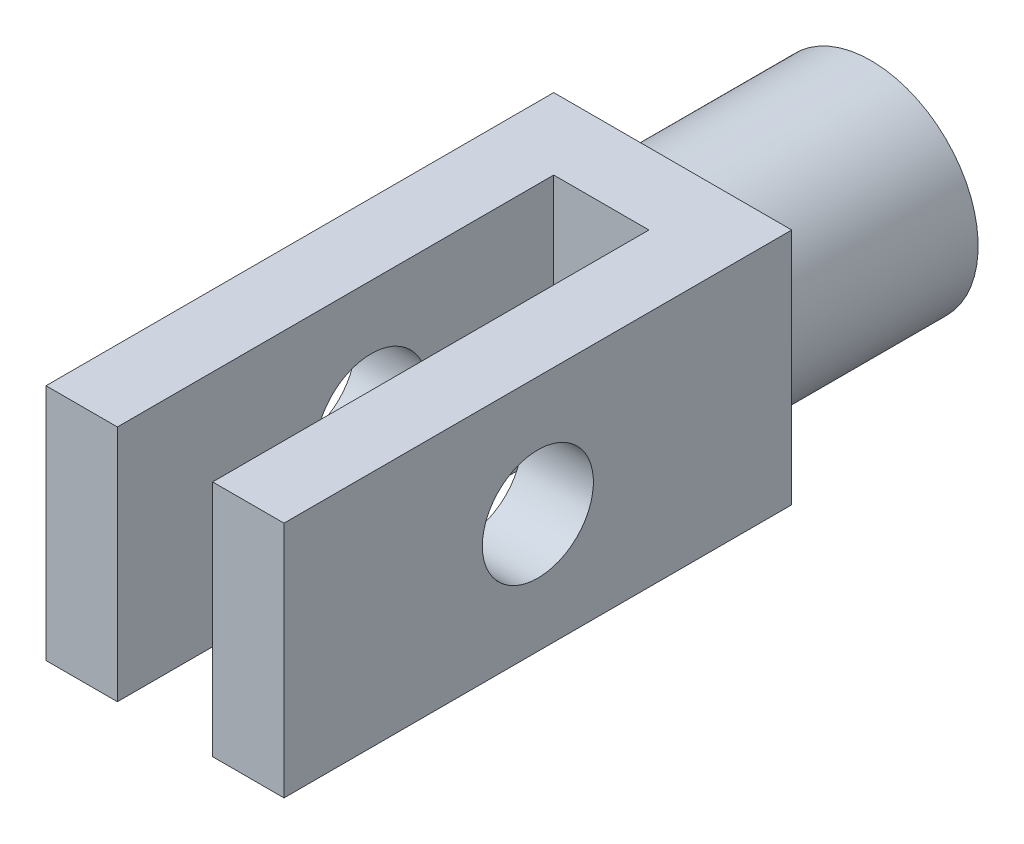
from build123d import *

# Parameters (mm, degrees)
SKETCH1_W           = 30
SKETCH1_H           = 30
BOSS_EXTRUDE1_DEPTH = 9
SKETCH2_W           = 9
SKETCH2_H           = 30
BOSS_EXTRUDE2_DEPTH = 55
SKETCH3_R           = 13.5
BOSS_EXTRUDE3_DEPTH = 25
SKETCH4_R           = 8
CUT_EXTRUDE1_DEPTH  = 25
SKETCH5_R           = 7
CUT_EXTRUDE2_DEPTH  = 73.256487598


with BuildPart() as part:
    # Sketch1 → Boss-Extrude1 (new body)
    with BuildSketch(Plane.XY):
        Rectangle(SKETCH1_W, SKETCH1_H)
    extrude(amount=BOSS_EXTRUDE1_DEPTH)

    # Sketch2 → Boss-Extrude2 (add)
    with BuildSketch(Plane.XY.offset(9)):
        with Locations((-10.5, 0)):
            Rectangle(SKETCH2_W, SKETCH2_H)
        with Locations((10.5, 0)):
            Rectangle(SKETCH2_W, SKETCH2_H)
    extrude(amount=BOSS_EXTRUDE2_DEPTH)

    # Sketch3 → Boss-Extrude3 (add)
    with BuildSketch(Plane(origin=(0, 0, 0), x_dir=(-1, 0, 0), z_dir=(0, 0, -1))):
        Circle(SKETCH3_R)
    extrude(amount=BOSS_EXTRUDE3_DEPTH)

    # Sketch4 → Cut-Extrude1 (cut)
    with BuildSketch(Plane(origin=(0, 0, -25), x_dir=(-1, 0, 0), z_dir=(0, 0, -1))):
        Circle(SKETCH4_R)
    extrude(amount=-CUT_EXTRUDE1_DEPTH, mode=Mode.SUBTRACT)

    # Sketch5 → Cut-Extrude2 (cut, through all)
    with BuildSketch(Plane.ZY.offset(15)):
        with Locations((32, 0)):
            Circle(SKETCH5_R)
    extrude(amount=-CUT_EXTRUDE2_DEPTH, mode=Mode.SUBTRACT)


solid = part.part
